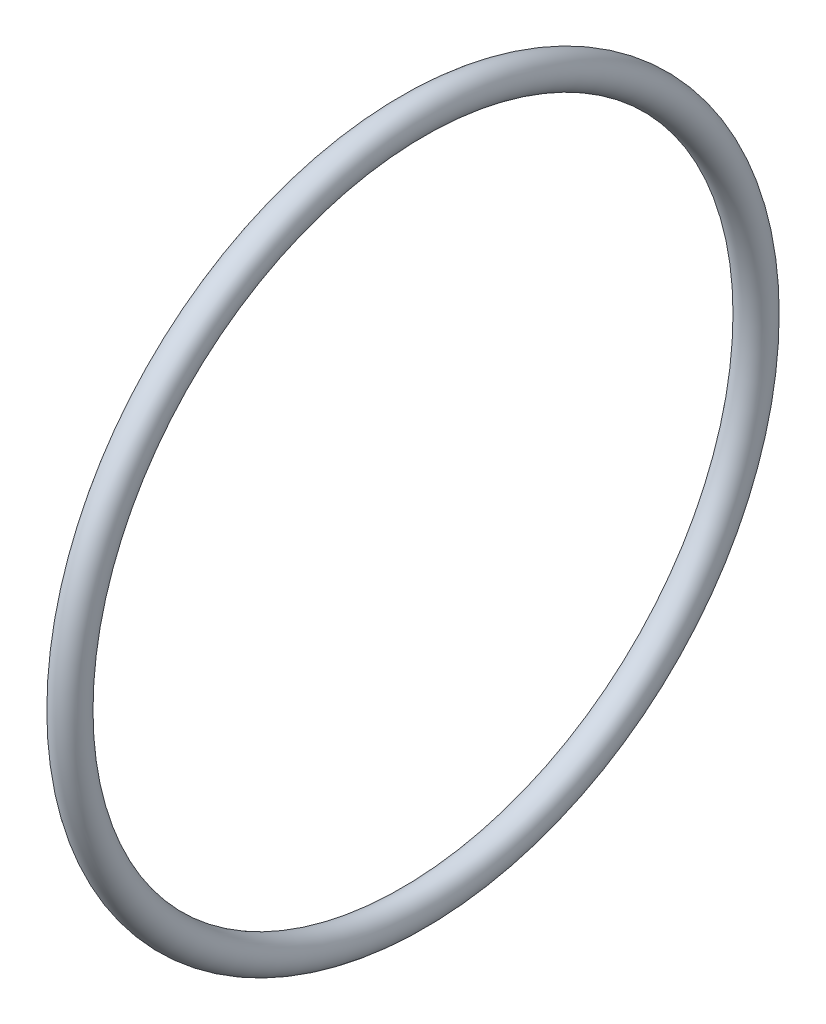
from build123d import *

# Parameters (mm, degrees)
SKIZZE1_R = 1.5


with BuildPart() as part:
    # Skizze1 → Rotation1 (revolve)
    with BuildSketch(Plane.XY, mode=Mode.PRIVATE) as rotation1_sk:
        with Locations((0, 31.5)):
            Circle(SKIZZE1_R)
    revolve(rotation1_sk.sketch.rotate(Axis((0, 0, 0), (1, 0, 0)), 90), axis=Axis((0, 0, 0), (1, 0, 0)))


solid = part.part
